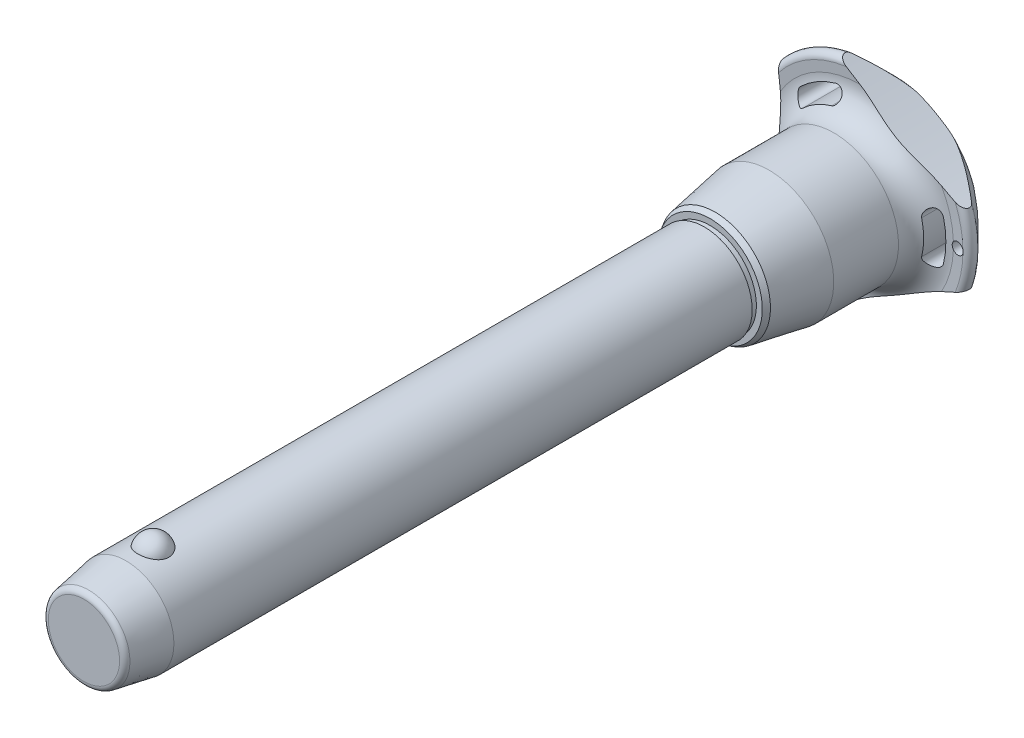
from build123d import *

# Parameters (mm, degrees)
SKETCH1_R           = 12.5
BOSS_EXTRUDE1_DEPTH = 140
SKETCH2_R           = 10
BOSS_EXTRUDE2_DEPTH = 50.7
BOSS_EXTRUDE3_START = 22
SKETCH1_2_R         = 12.5
BOSS_EXTRUDE3_DEPTH = 22
CHAMFER1_SIZE       = 11
CHAMFER1_SIZE2      = 1.939596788
FILLET1_R           = 1.5
SKETCH6_R           = 176.92625
CUT_EXTRUDE1_DEPTH  = 195.927884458
CIRPATTERN1_COUNT   = 3
SKETCH7_R           = 1.5
CUT_EXTRUDE2_DEPTH  = 195.849774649


with BuildPart() as part:
    # Sketch1 → Boss-Extrude1 (new body)
    with BuildSketch(Plane.XY):
        Circle(SKETCH1_R)
    extrude(amount=-BOSS_EXTRUDE1_DEPTH)

    # Sketch2 → Boss-Extrude2 (add)
    with BuildSketch(Plane(origin=(0, 0, -140), x_dir=(-1, 0, 0), z_dir=(0, 0, -1))):
        with Locations(Location((0, 0, 0), (0, 0, 180))):
            Circle(SKETCH2_R)
    extrude(amount=BOSS_EXTRUDE2_DEPTH)

    # Sketch3 → Revolve1 (revolve)
    with BuildSketch(Plane(origin=(0, 0, 0), x_dir=(0, 0, -1), z_dir=(1, 0, 0))):
        with BuildLine():
            Line((-3.957271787, 15.4), (-3.957271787, 7.1))
            ThreePointArc((-3.957271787, 7.1), (0.192728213, 11.25), (-3.957271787, 15.4))
        make_face()
        with BuildLine():
            Line((-3.957271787, -7.1), (-3.957271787, -15.4))
            ThreePointArc((-3.957271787, -15.4), (0.192728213, -11.25), (-3.957271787, -7.1))
        make_face()
    revolve(axis=Axis((0, -7.1, 3.957271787), (0, 1, 0)))

    # Sketch1_2 → Boss-Extrude3 (add)
    with BuildSketch(Plane.XY.offset(BOSS_EXTRUDE3_START)):
        Circle(SKETCH1_2_R)
    extrude(amount=-BOSS_EXTRUDE3_DEPTH)

    # Chamfer1
    chamfer1_edges = [part.edges().sort_by_distance(p)[0] for p in [
        (-12.5, 0, 22),
    ]]
    chamfer1_side = [part.faces().sort_by_distance(p)[0] for p in [
        (-12.5, 0, -59),
    ]]
    chamfer(chamfer1_edges, length=CHAMFER1_SIZE, length2=CHAMFER1_SIZE2, reference=chamfer1_side[0])

    # Fillet1
    fillet1_edges = [part.edges().sort_by_distance(p)[0] for p in [
        (-10.560403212, 0, 22),
        (-10, 0, -190.7),
    ]]
    fillet(fillet1_edges, radius=FILLET1_R)

    # Sketch4 → Revolve2 (revolve)
    with BuildSketch(Plane(origin=(0, 0, 0), x_dir=(0, 0, -1), z_dir=(1, 0, 0)), mode=Mode.PRIVATE) as revolve2_sk:
        Polygon((140, 0), (140, 12.089202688), (141.5, 12.089202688), (141.5, 13.644437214), (142.846872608, 14.422054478), (156.9, 16.9), (173.8, 16.9), (173.8, 0), align=None)
    revolve(revolve2_sk.sketch.rotate(Axis((0, 0, -173.8), (0, 0, 1)), 90), axis=Axis((0, 0, -173.8), (0, 0, 1)))

    # Sketch5 → Revolve3 (revolve)
    with BuildSketch(Plane(origin=(0, 0, 0), x_dir=(0, 0, -1), z_dir=(1, 0, 0)), mode=Mode.PRIVATE) as revolve3_sk:
        with BuildLine():
            Line((180.790129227, 24.271609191), (180.652256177, 26.865060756))
            ThreePointArc((180.652256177, 26.865060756), (181.598671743, 28.411427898), (183.38137085, 28.08137085))
            Line((183.38137085, 28.08137085), (189.763226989, 21.69951471))
            ThreePointArc((189.763226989, 21.69951471), (190.7, 19.381044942), (189.683055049, 17.096604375))
            ThreePointArc((189.683055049, 17.096604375), (184.18864484, 9.321268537), (182.25, 0))
            Line((182.25, 0), (173.8, 0))
            Line((173.8, 0), (173.8, 16.9))
            ThreePointArc((173.8, 16.9), (178.879432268, 19.083427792), (180.790129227, 24.271609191))
        make_face()
    revolve(revolve3_sk.sketch.rotate(Axis((0, 0, -182.25), (0, 0, 1)), 90), axis=Axis((0, 0, -182.25), (0, 0, 1)))

    # Sketch6 → Cut-Extrude1 (cut, through all)
    with BuildSketch(Plane.XY):
        with Locations((-197.42625, 0)):
            Circle(SKETCH6_R)
        with BuildLine():
            ThreePointArc((21.802992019, -5.260839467), (22.428706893, 0), (21.802992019, 5.260839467))
            ThreePointArc((21.802992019, 5.260839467), (19.579234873, 6.620060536), (18.220013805, 4.39630339))
            ThreePointArc((18.220013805, 4.39630339), (18.742902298, 0), (18.220013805, -4.39630339))
            ThreePointArc((18.220013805, -4.39630339), (19.579234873, -6.620060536), (21.802992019, -5.260839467))
        make_face()
    cut_extrude1 = extrude(amount=-CUT_EXTRUDE1_DEPTH, mode=Mode.SUBTRACT)

    # CirPattern1: Cut-Extrude1 ×3 about axis
    cirpattern1_axis = Axis((0, 0, 0), (0, 0, 1))
    for i in range(1, CIRPATTERN1_COUNT):
        add(cut_extrude1.rotate(cirpattern1_axis, i * 360 / CIRPATTERN1_COUNT), mode=Mode.SUBTRACT)

    # Sketch7 → Cut-Extrude2 (cut, through all)
    with BuildSketch(Plane.XY):
        with Locations(Location((25.428706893, 0, 0), (0, 0, 17.230769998))):
            Circle(SKETCH7_R)
    extrude(amount=-CUT_EXTRUDE2_DEPTH, mode=Mode.SUBTRACT)


solid = part.part
